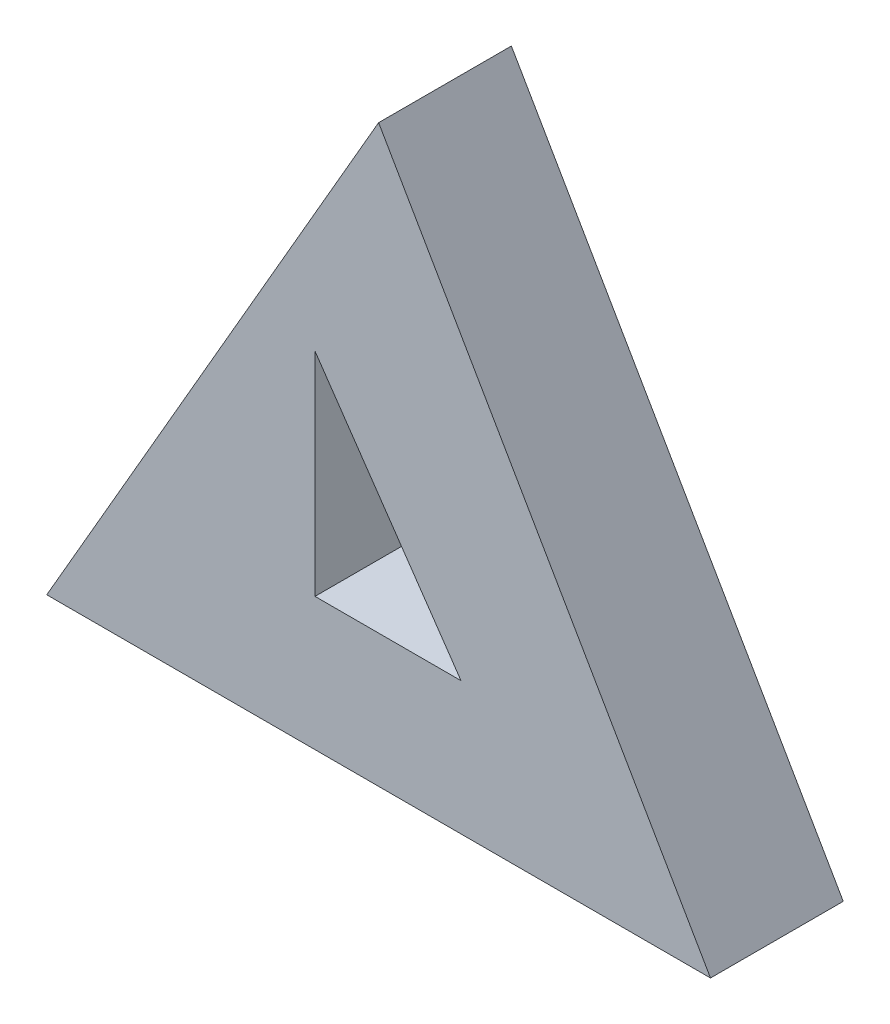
from build123d import *

# Parameters (mm, degrees)
DODANIE_WYCI_GNI_CIE1_DEPTH = 20
WYTNIJ_WYCI_GNI_CIE1_DEPTH  = 124.075832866


with BuildPart() as part:
    # Szkic1 → Dodanie-wyci_gni_cie1 (new body)
    with BuildSketch(Plane.XY):
        Polygon((0, 0), (100, 0), (50, 86.602540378), align=None)
    extrude(amount=DODANIE_WYCI_GNI_CIE1_DEPTH)

    # Tr_jk_t_2 → Wytnij-wyci_gni_cie1 (cut, through all)
    with BuildSketch(Plane(origin=(18.348999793, -3.29058951, 20), x_dir=(1, 0, 0), z_dir=(0, 0, 1))):
        Polygon((22.06551905, 55.29058951), (22.06551905, 23.29058951), (44.06551905, 23.29058951), align=None)
    extrude(amount=-WYTNIJ_WYCI_GNI_CIE1_DEPTH, mode=Mode.SUBTRACT)


solid = part.part
